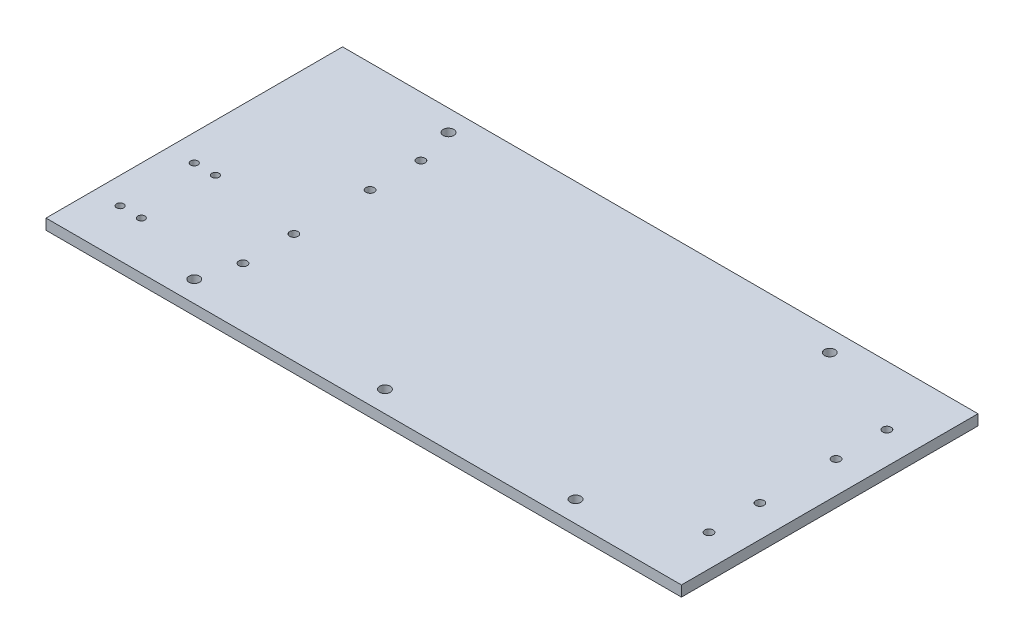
from build123d import *

# Parameters (mm, degrees)
SKETCH1_W                  = 381
SKETCH1_H                  = 177.8
PLATE_DEPTH                = 6.35
SKETCH4_R                  = 3.175
CHASSISMOUNTINGHOLES_DEPTH = 6.35
SKETCH5_R                  = 2.5019
LEADSCREWGUIDEMOUNTS_DEPTH = 6.35
SKETCH6_R                  = 2.15265
LEADSCREWMOTORMOUNT_DEPTH  = 6.35


with BuildPart() as part:
    # Sketch1 → Plate (new body)
    with BuildSketch(Plane(origin=(0, 0, 0), x_dir=(1, 0, 0), z_dir=(0, 1, 0))):
        Rectangle(SKETCH1_W, SKETCH1_H)
    extrude(amount=PLATE_DEPTH)

    # Sketch4 → ChassisMountingHoles (cut)
    with BuildSketch(Plane.XZ):
        with Locations(Location((0, 76.2, 0), (0, 0, 270))):
            Circle(SKETCH4_R)
        with Locations(Location((-114.3, 76.2, 0), (0, 0, 270))):
            Circle(SKETCH4_R)
        with Locations(Location((114.3, 76.2, 0), (0, 0, 270))):
            Circle(SKETCH4_R)
        with Locations(Location((-114.3, -76.2, 0), (0, 0, 270))):
            Circle(SKETCH4_R)
        with Locations(Location((114.3, -76.2, 0), (0, 0, 270))):
            Circle(SKETCH4_R)
    extrude(amount=-CHASSISMOUNTINGHOLES_DEPTH, mode=Mode.SUBTRACT)

    # Sketch5 → LeadScrewGuideMounts (cut)
    with BuildSketch(Plane.XZ):
        with Locations(Location((171.45, 53.34, 0), (0, 0, 270))):
            Circle(SKETCH5_R)
        with Locations(Location((171.45, 22.86, 0), (0, 0, 270))):
            Circle(SKETCH5_R)
        with Locations(Location((-107.95, 53.34, 0), (0, 0, 270))):
            Circle(SKETCH5_R)
        with Locations(Location((-107.95, 22.86, 0), (0, 0, 270))):
            Circle(SKETCH5_R)
        with Locations(Location((171.45, -53.34, 0), (0, 0, 270))):
            Circle(SKETCH5_R)
        with Locations(Location((171.45, -22.86, 0), (0, 0, 270))):
            Circle(SKETCH5_R)
        with Locations(Location((-107.95, -22.86, 0), (0, 0, 270))):
            Circle(SKETCH5_R)
        with Locations(Location((-107.95, -53.34, 0), (0, 0, 270))):
            Circle(SKETCH5_R)
    extrude(amount=-LEADSCREWGUIDEMOUNTS_DEPTH, mode=Mode.SUBTRACT)

    # Sketch6 → LeadScrewMotorMount (cut)
    with BuildSketch(Plane.XZ):
        with Locations(Location((-174.625, 60.325, 0), (0, 0, 270))):
            Circle(SKETCH6_R)
        with Locations(Location((-161.925, 60.325, 0), (0, 0, 270))):
            Circle(SKETCH6_R)
        with Locations(Location((-174.625, 15.875, 0), (0, 0, 270))):
            Circle(SKETCH6_R)
        with Locations(Location((-161.925, 15.875, 0), (0, 0, 270))):
            Circle(SKETCH6_R)
    extrude(amount=-LEADSCREWMOTORMOUNT_DEPTH, mode=Mode.SUBTRACT)


solid = part.part
